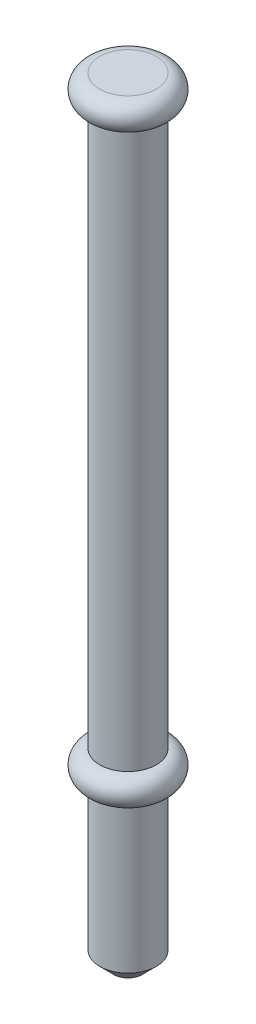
ISO-10303-21;
HEADER;
FILE_DESCRIPTION(('STEP AP214'),'2;1');
FILE_NAME('part.step','',(''),(''),'','','');
FILE_SCHEMA(('AUTOMOTIVE_DESIGN { 1 0 10303 214 1 1 1 1 }'));
ENDSEC;
DATA;
#1=APPLICATION_CONTEXT('core data for automotive mechanical design processes');
#2=APPLICATION_PROTOCOL_DEFINITION('international standard','automotive_design',2000,#1);
#3=PRODUCT_CONTEXT('',#1,'mechanical');
#4=PRODUCT('Part','Part','',(#3));
#5=PRODUCT_RELATED_PRODUCT_CATEGORY('part','',(#4));
#6=PRODUCT_DEFINITION_FORMATION('','',#4);
#7=PRODUCT_DEFINITION_CONTEXT('part definition',#1,'design');
#8=PRODUCT_DEFINITION('design','',#6,#7);
#9=PRODUCT_DEFINITION_SHAPE('','',#8);
#10=(LENGTH_UNIT() NAMED_UNIT(*) SI_UNIT(.MILLI.,.METRE.));
#11=(NAMED_UNIT(*) PLANE_ANGLE_UNIT() SI_UNIT($,.RADIAN.));
#12=(NAMED_UNIT(*) SI_UNIT($,.STERADIAN.) SOLID_ANGLE_UNIT());
#13=UNCERTAINTY_MEASURE_WITH_UNIT(LENGTH_MEASURE(1.E-05),#10,'distance_accuracy_value','');
#14=(GEOMETRIC_REPRESENTATION_CONTEXT(3) GLOBAL_UNCERTAINTY_ASSIGNED_CONTEXT((#13)) GLOBAL_UNIT_ASSIGNED_CONTEXT((#10,
#11,#12)) REPRESENTATION_CONTEXT('',''));
#15=CARTESIAN_POINT('',(0.,0.,0.));
#16=DIRECTION('',(0.,0.,1.));
#17=DIRECTION('',(1.,0.,0.));
#18=AXIS2_PLACEMENT_3D('',#15,#16,#17);
#19=CARTESIAN_POINT('',(0.,164.,0.));
#20=DIRECTION('',(0.,-1.,0.));
#21=DIRECTION('',(0.,0.,-1.));
#22=AXIS2_PLACEMENT_3D('',#19,#20,#21);
#23=CYLINDRICAL_SURFACE('',#22,6.);
#24=CARTESIAN_POINT('',(0.,40.,0.));
#25=DIRECTION('',(0.,-1.,0.));
#26=DIRECTION('',(0.,0.,-1.));
#27=AXIS2_PLACEMENT_3D('',#24,#25,#26);
#28=CIRCLE('',#27,6.);
#29=CARTESIAN_POINT('',(0.,40.,-6.00000000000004));
#30=VERTEX_POINT('',#29);
#31=EDGE_CURVE('E59',#30,#30,#28,.T.);
#32=ORIENTED_EDGE('',*,*,#31,.F.);
#33=EDGE_LOOP('',(#32));
#34=FACE_BOUND('',#33,.T.);
#35=CARTESIAN_POINT('',(0.,158.,0.));
#36=DIRECTION('',(0.,-1.,0.));
#37=DIRECTION('',(0.,0.,-1.));
#38=AXIS2_PLACEMENT_3D('',#35,#36,#37);
#39=CIRCLE('',#38,6.);
#40=CARTESIAN_POINT('',(0.,158.,-6.00000000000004));
#41=VERTEX_POINT('',#40);
#42=EDGE_CURVE('E47',#41,#41,#39,.T.);
#43=ORIENTED_EDGE('',*,*,#42,.T.);
#44=EDGE_LOOP('',(#43));
#45=FACE_BOUND('',#44,.T.);
#46=ADVANCED_FACE('F37',(#34,#45),#23,.T.);
#47=CARTESIAN_POINT('',(0.,161.,0.));
#48=DIRECTION('',(0.,-1.,0.));
#49=DIRECTION('',(0.,0.,-1.));
#50=AXIS2_PLACEMENT_3D('',#47,#48,#49);
#51=TOROIDAL_SURFACE('',#50,6.,3.);
#52=CARTESIAN_POINT('',(0.,164.,0.));
#53=DIRECTION('',(0.,-1.,0.));
#54=DIRECTION('',(0.,0.,-1.));
#55=AXIS2_PLACEMENT_3D('',#52,#53,#54);
#56=CIRCLE('',#55,6.);
#57=CARTESIAN_POINT('',(0.,164.,-6.00000000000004));
#58=VERTEX_POINT('',#57);
#59=EDGE_CURVE('E51',#58,#58,#56,.T.);
#60=ORIENTED_EDGE('',*,*,#59,.T.);
#61=EDGE_LOOP('',(#60));
#62=FACE_BOUND('',#61,.T.);
#63=ORIENTED_EDGE('',*,*,#42,.F.);
#64=EDGE_LOOP('',(#63));
#65=FACE_BOUND('',#64,.T.);
#66=ADVANCED_FACE('F68',(#62,#65),#51,.T.);
#67=CARTESIAN_POINT('',(0.,164.,0.));
#68=DIRECTION('',(0.,1.,0.));
#69=DIRECTION('',(0.,0.,1.));
#70=AXIS2_PLACEMENT_3D('',#67,#68,#69);
#71=PLANE('',#70);
#72=ORIENTED_EDGE('',*,*,#59,.F.);
#73=EDGE_LOOP('',(#72));
#74=FACE_BOUND('',#73,.T.);
#75=ADVANCED_FACE('F73',(#74),#71,.T.);
#76=CARTESIAN_POINT('',(0.,37.,0.));
#77=DIRECTION('',(0.,-1.,0.));
#78=DIRECTION('',(0.,0.,-1.));
#79=AXIS2_PLACEMENT_3D('',#76,#77,#78);
#80=TOROIDAL_SURFACE('',#79,6.,3.);
#81=ORIENTED_EDGE('',*,*,#31,.T.);
#82=EDGE_LOOP('',(#81));
#83=FACE_BOUND('',#82,.T.);
#84=CARTESIAN_POINT('',(0.,34.,0.));
#85=DIRECTION('',(0.,-1.,0.));
#86=DIRECTION('',(0.,0.,-1.));
#87=AXIS2_PLACEMENT_3D('',#84,#85,#86);
#88=CIRCLE('',#87,6.);
#89=CARTESIAN_POINT('',(0.,34.,-6.00000000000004));
#90=VERTEX_POINT('',#89);
#91=EDGE_CURVE('E56',#90,#90,#88,.T.);
#92=ORIENTED_EDGE('',*,*,#91,.F.);
#93=EDGE_LOOP('',(#92));
#94=FACE_BOUND('',#93,.T.);
#95=ADVANCED_FACE('F63',(#83,#94),#80,.T.);
#96=CARTESIAN_POINT('',(0.,0.,0.));
#97=DIRECTION('',(0.,1.,0.));
#98=DIRECTION('',(0.,0.,1.));
#99=AXIS2_PLACEMENT_3D('',#96,#97,#98);
#100=PLANE('',#99);
#101=CARTESIAN_POINT('',(0.,0.,0.));
#102=DIRECTION('',(0.,1.,0.));
#103=DIRECTION('',(0.,0.,1.));
#104=AXIS2_PLACEMENT_3D('',#101,#102,#103);
#105=CIRCLE('',#104,2.99999999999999);
#106=CARTESIAN_POINT('',(0.,0.,2.99999999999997));
#107=VERTEX_POINT('',#106);
#108=EDGE_CURVE('E12',#107,#107,#105,.F.);
#109=ORIENTED_EDGE('',*,*,#108,.T.);
#110=EDGE_LOOP('',(#109));
#111=FACE_BOUND('',#110,.T.);
#112=ADVANCED_FACE('F83',(#111),#100,.F.);
#113=CARTESIAN_POINT('',(0.,3.,0.));
#114=DIRECTION('',(0.,1.,0.));
#115=DIRECTION('',(0.,0.,1.));
#116=AXIS2_PLACEMENT_3D('',#113,#114,#115);
#117=CIRCLE('',#116,6.);
#118=CARTESIAN_POINT('',(0.,3.,5.99999999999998));
#119=VERTEX_POINT('',#118);
#120=EDGE_CURVE('E43',#119,#119,#117,.T.);
#121=ORIENTED_EDGE('',*,*,#120,.T.);
#122=EDGE_LOOP('',(#121));
#123=FACE_BOUND('',#122,.T.);
#124=ORIENTED_EDGE('',*,*,#91,.T.);
#125=EDGE_LOOP('',(#124));
#126=FACE_BOUND('',#125,.T.);
#127=ADVANCED_FACE('F69',(#123,#126),#23,.T.);
#128=CARTESIAN_POINT('',(0.,3.,0.));
#129=DIRECTION('',(0.,1.,0.));
#130=DIRECTION('',(0.,0.,1.));
#131=AXIS2_PLACEMENT_3D('',#128,#129,#130);
#132=CONICAL_SURFACE('',#131,6.,0.785398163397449);
#133=ORIENTED_EDGE('',*,*,#108,.F.);
#134=EDGE_LOOP('',(#133));
#135=FACE_BOUND('',#134,.T.);
#136=ORIENTED_EDGE('',*,*,#120,.F.);
#137=EDGE_LOOP('',(#136));
#138=FACE_BOUND('',#137,.T.);
#139=ADVANCED_FACE('F89',(#135,#138),#132,.T.);
#140=CLOSED_SHELL('',(#46,#66,#75,#95,#112,#127,#139));
#141=MANIFOLD_SOLID_BREP('B2',#140);
#142=ADVANCED_BREP_SHAPE_REPRESENTATION('',(#18,#141),#14);
#143=SHAPE_DEFINITION_REPRESENTATION(#9,#142);
ENDSEC;
END-ISO-10303-21;
